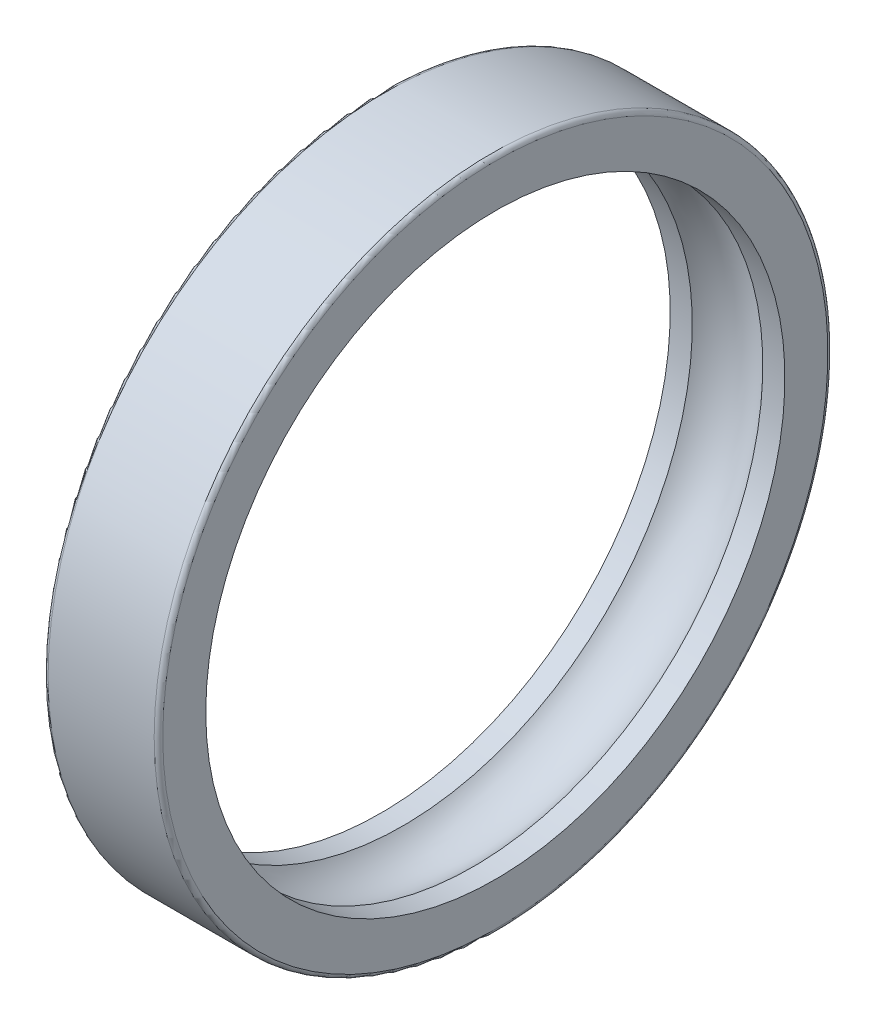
from build123d import *


with BuildPart() as part:
    # Esquisse1 → Base-R_volution (revolve)
    with BuildSketch(Plane(origin=(0, 0, 0), x_dir=(1, 0, 0), z_dir=(0, 1, 0)), mode=Mode.PRIVATE) as base_r_volution_sk:
        with BuildLine():
            Line((0, 23.2), (0, 20.2))
            Line((0, 20.2), (1.540325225, 20.2))
            ThreePointArc((1.540325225, 20.2), (4, 21.3), (6.459674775, 20.2))
            Line((6.459674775, 20.2), (8, 20.2))
            Line((8, 20.2), (8, 23.2))
            ThreePointArc((8, 23.2), (7.912132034, 23.412132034), (7.7, 23.5))
            Line((7.7, 23.5), (0.3, 23.5))
            ThreePointArc((0.3, 23.5), (0.087867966, 23.412132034), (0, 23.2))
        make_face()
    revolve(base_r_volution_sk.sketch.rotate(Axis((0, 0, 0), (1, 0, 0)), 180), axis=Axis((0, 0, 0), (1, 0, 0)))


solid = part.part
